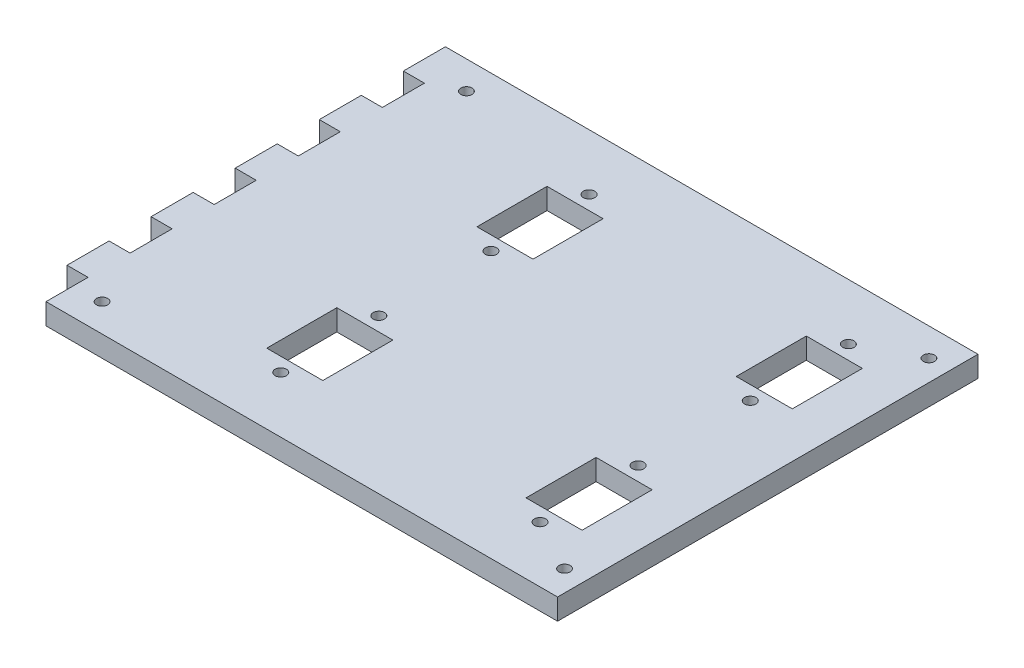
from build123d import *

# Parameters (mm, degrees)
ESQUISSE2_W                = 380
ESQUISSE2_H                = 300
BOSS_EXTRU_1_DEPTH         = 15
ESQUISSE3_W                = 15
ESQUISSE3_H                = 30
ENL_V_MAT_EXTRU_1_DEPTH    = 485.381048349
R_P_TITION_LIN_AIRE2_COUNT = 10
R_P_TITION_LIN_AIRE2_PITCH = 60
ESQUISSE4_W                = 40
ESQUISSE4_H                = 50
ENL_V_MAT_EXTRU_2_DEPTH    = 485.381048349
ESQUISSE6_R                = 4
ENL_V_MAT_EXTRU_3_DEPTH    = 485.381048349
ESQUISSE7_R                = 4.05
ENL_V_MAT_EXTRU_4_DEPTH    = 485.381048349


with BuildPart() as part:
    # Esquisse2 → Boss.-Extru.1 (new body)
    with BuildSketch(Plane(origin=(0, 0, 0), x_dir=(1, 0, 0), z_dir=(0, 1, 0))):
        with Locations((190, -150)):
            Rectangle(ESQUISSE2_W, ESQUISSE2_H)
    extrude(amount=BOSS_EXTRU_1_DEPTH)

    # Esquisse3 → Enl_v. mat.-Extru.1 (cut, through all)
    with BuildSketch(Plane(origin=(0, 15, 0), x_dir=(1, 0, 0), z_dir=(0, 1, 0))):
        with Locations((7.5, -45)):
            Rectangle(ESQUISSE3_W, ESQUISSE3_H)
    enl_v_mat_extru_1 = extrude(amount=-ENL_V_MAT_EXTRU_1_DEPTH, mode=Mode.SUBTRACT)

    # R_p_tition lin_aire2: Enl_v. mat.-Extru.1 ×10
    with Locations(*[(0, 0, i * R_P_TITION_LIN_AIRE2_PITCH) for i in range(1, R_P_TITION_LIN_AIRE2_COUNT)]):
        add(enl_v_mat_extru_1, mode=Mode.SUBTRACT)

    # Esquisse4 → Enl_v. mat.-Extru.2 (cut, through all)
    with BuildSketch(Plane.XZ):
        with Locations((327.5, 75)):
            Rectangle(ESQUISSE4_W, ESQUISSE4_H)
        with Locations((327.5, 225)):
            Rectangle(ESQUISSE4_W, ESQUISSE4_H)
        with Locations((142.5, 75)):
            Rectangle(ESQUISSE4_W, ESQUISSE4_H)
        with Locations((142.5, 225)):
            Rectangle(ESQUISSE4_W, ESQUISSE4_H)
    extrude(amount=-ENL_V_MAT_EXTRU_2_DEPTH, mode=Mode.SUBTRACT)

    # Esquisse6 → Enl_v. mat.-Extru.3 (cut, through all)
    with BuildSketch(Plane(origin=(0, 15, 0), x_dir=(1, 0, 0), z_dir=(0, 1, 0))):
        with Locations(Location((365, -280, 0), (0, 0, 270))):
            Circle(ESQUISSE6_R)
        with Locations(Location((365, -20, 0), (0, 0, 270))):
            Circle(ESQUISSE6_R)
        with Locations(Location((35, -280, 0), (0, 0, 270))):
            Circle(ESQUISSE6_R)
        with Locations(Location((35, -20, 0), (0, 0, 270))):
            Circle(ESQUISSE6_R)
    extrude(amount=-ENL_V_MAT_EXTRU_3_DEPTH, mode=Mode.SUBTRACT)

    # Esquisse7 → Enl_v. mat.-Extru.4 (cut, through all)
    with BuildSketch(Plane(origin=(0, 15, 0), x_dir=(1, 0, 0), z_dir=(0, 1, 0))):
        with Locations(Location((327.5, -40, 0), (0, 0, 270))):
            Circle(ESQUISSE7_R)
        with Locations(Location((327.5, -110, 0), (0, 0, 270))):
            Circle(ESQUISSE7_R)
        with Locations(Location((327.5, -190, 0), (0, 0, 270))):
            Circle(ESQUISSE7_R)
        with Locations(Location((327.5, -260, 0), (0, 0, 270))):
            Circle(ESQUISSE7_R)
        with Locations(Location((142.5, -260, 0), (0, 0, 270))):
            Circle(ESQUISSE7_R)
        with Locations(Location((142.5, -190, 0), (0, 0, 270))):
            Circle(ESQUISSE7_R)
        with Locations(Location((142.5, -40, 0), (0, 0, 270))):
            Circle(ESQUISSE7_R)
        with Locations(Location((142.5, -110, 0), (0, 0, 270))):
            Circle(ESQUISSE7_R)
    extrude(amount=-ENL_V_MAT_EXTRU_4_DEPTH, mode=Mode.SUBTRACT)


solid = part.part
